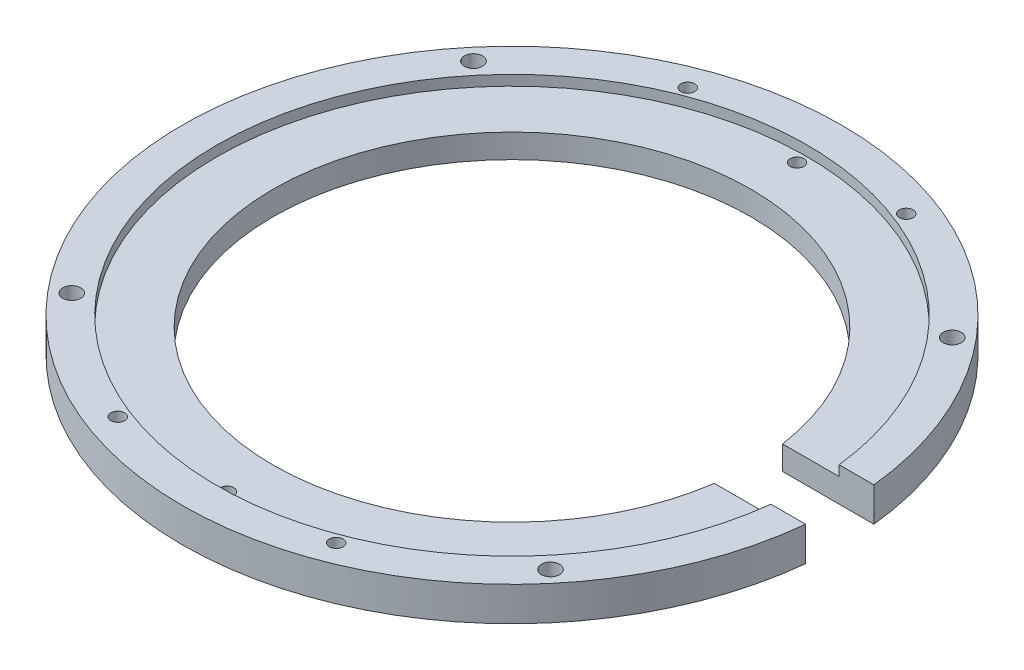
from build123d import *

# Parameters (mm, degrees)
F_1_4_20_TAPPED_HOLE1_D          = 5.1054
F_17_64_0_26563_DIAMETER_HOLE1_D = 6.747002
SKETCH8_W                        = 76.2
SKETCH8_H                        = 25.4
CUT_EXTRUDE1_DEPTH               = 174.873181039


with BuildPart() as part:
    # Sketch1 → Revolve1 (revolve)
    with BuildSketch(Plane.XY, mode=Mode.PRIVATE) as revolve1_sk:
        Polygon((-88.9, 0), (-122.6185, 0), (-122.6185, 12.7), (-109.7915, 12.7), (-109.7915, 8.89), (-88.9, 8.89), align=None)
    revolve(revolve1_sk.sketch.rotate(Axis((0, 0, 0), (0, 1, 0)), 270), axis=Axis((0, 0, 0), (0, 1, 0)))

    # 1_4-20 Tapped Hole1 (through all)
    with Locations(Plane(origin=(0, 0, 0), x_dir=(-1, 0, 0), z_dir=(0, -1, 0))):
        with Locations((40.64, -106.045), (-40.64, -106.045), (40.64, 106.045), (-40.64, 106.045), (0, 106.045), (0, -106.045)):
            Hole(F_1_4_20_TAPPED_HOLE1_D / 2)

    # 17_64 _0.26563_ Diameter Hole1 (through all)
    with Locations(Plane(origin=(0, 0, 0), x_dir=(-1, 0, 0), z_dir=(0, -1, 0))):
        with Locations((89.066838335, 74.735951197), (89.066838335, -74.735951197), (-89.066838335, -74.735951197), (-89.066838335, 74.735951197)):
            Hole(F_17_64_0_26563_DIAMETER_HOLE1_D / 2)

    # Sketch8 → Cut-Extrude1 (cut, through all)
    with BuildSketch(Plane.XZ):
        with Locations((99.229842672, 0)):
            Rectangle(SKETCH8_W, SKETCH8_H)
    extrude(amount=-CUT_EXTRUDE1_DEPTH, mode=Mode.SUBTRACT)


solid = part.part
